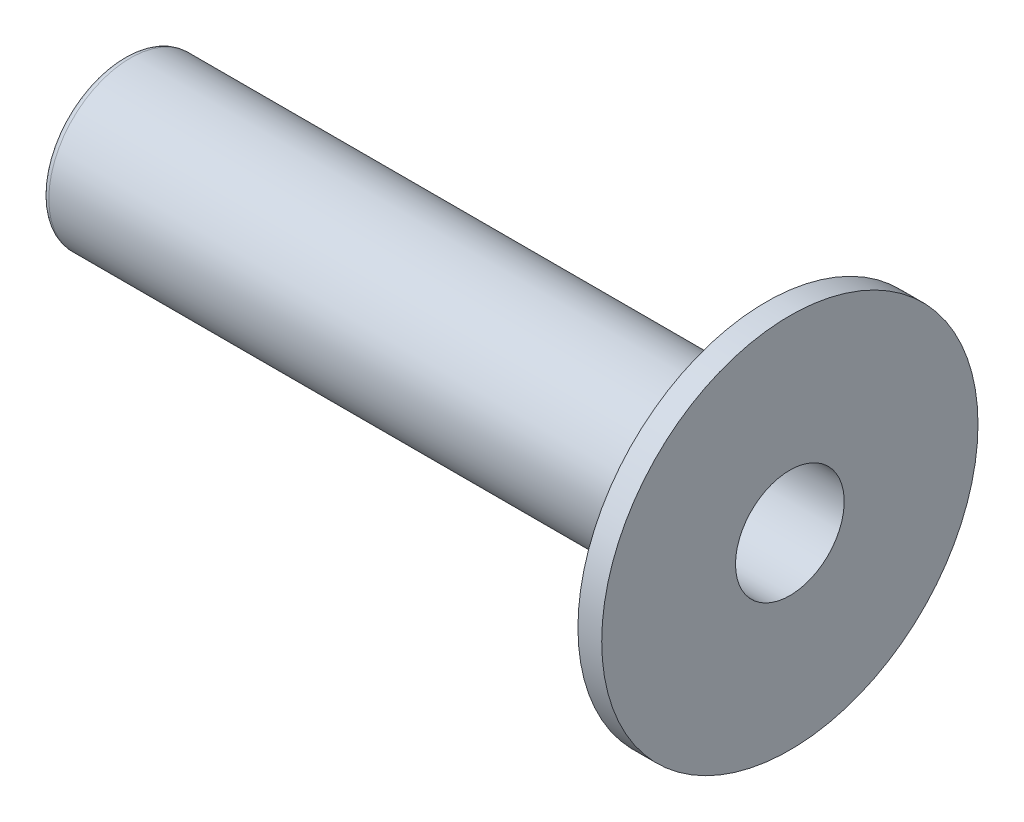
ISO-10303-21;
HEADER;
FILE_DESCRIPTION(('STEP AP214'),'2;1');
FILE_NAME('part.step','',(''),(''),'','','');
FILE_SCHEMA(('AUTOMOTIVE_DESIGN { 1 0 10303 214 1 1 1 1 }'));
ENDSEC;
DATA;
#1=APPLICATION_CONTEXT('core data for automotive mechanical design processes');
#2=APPLICATION_PROTOCOL_DEFINITION('international standard','automotive_design',2000,#1);
#3=PRODUCT_CONTEXT('',#1,'mechanical');
#4=PRODUCT('Part','Part','',(#3));
#5=PRODUCT_RELATED_PRODUCT_CATEGORY('part','',(#4));
#6=PRODUCT_DEFINITION_FORMATION('','',#4);
#7=PRODUCT_DEFINITION_CONTEXT('part definition',#1,'design');
#8=PRODUCT_DEFINITION('design','',#6,#7);
#9=PRODUCT_DEFINITION_SHAPE('','',#8);
#10=(LENGTH_UNIT() NAMED_UNIT(*) SI_UNIT(.MILLI.,.METRE.));
#11=(NAMED_UNIT(*) PLANE_ANGLE_UNIT() SI_UNIT($,.RADIAN.));
#12=(NAMED_UNIT(*) SI_UNIT($,.STERADIAN.) SOLID_ANGLE_UNIT());
#13=UNCERTAINTY_MEASURE_WITH_UNIT(LENGTH_MEASURE(1.E-05),#10,'distance_accuracy_value','');
#14=(GEOMETRIC_REPRESENTATION_CONTEXT(3) GLOBAL_UNCERTAINTY_ASSIGNED_CONTEXT((#13)) GLOBAL_UNIT_ASSIGNED_CONTEXT((#10,
#11,#12)) REPRESENTATION_CONTEXT('',''));
#15=CARTESIAN_POINT('',(0.,0.,0.));
#16=DIRECTION('',(0.,0.,1.));
#17=DIRECTION('',(1.,0.,0.));
#18=AXIS2_PLACEMENT_3D('',#15,#16,#17);
#19=CARTESIAN_POINT('',(0.,1.35255,0.));
#20=DIRECTION('',(1.,0.,0.));
#21=DIRECTION('',(0.,0.,-1.));
#22=AXIS2_PLACEMENT_3D('',#19,#20,#21);
#23=PLANE('',#22);
#24=CARTESIAN_POINT('',(0.,0.,0.));
#25=DIRECTION('',(-1.,0.,0.));
#26=DIRECTION('',(0.,0.,1.));
#27=AXIS2_PLACEMENT_3D('',#24,#25,#26);
#28=CIRCLE('',#27,2.794);
#29=CARTESIAN_POINT('',(0.,0.,2.794));
#30=VERTEX_POINT('',#29);
#31=EDGE_CURVE('E56',#30,#30,#28,.T.);
#32=ORIENTED_EDGE('',*,*,#31,.T.);
#33=EDGE_LOOP('',(#32));
#34=FACE_BOUND('',#33,.T.);
#35=CARTESIAN_POINT('',(0.,0.,0.));
#36=DIRECTION('',(1.,0.,0.));
#37=DIRECTION('',(0.,0.,-1.));
#38=AXIS2_PLACEMENT_3D('',#35,#36,#37);
#39=CIRCLE('',#38,1.905);
#40=CARTESIAN_POINT('',(0.,0.,-1.905));
#41=VERTEX_POINT('',#40);
#42=EDGE_CURVE('E10',#41,#41,#39,.F.);
#43=ORIENTED_EDGE('',*,*,#42,.F.);
#44=EDGE_LOOP('',(#43));
#45=FACE_BOUND('',#44,.T.);
#46=ADVANCED_FACE('F30',(#34,#45),#23,.F.);
#47=CARTESIAN_POINT('',(0.,0.,0.));
#48=DIRECTION('',(-1.,0.,0.));
#49=DIRECTION('',(0.,0.,1.));
#50=AXIS2_PLACEMENT_3D('',#47,#48,#49);
#51=CYLINDRICAL_SURFACE('',#50,7.0358);
#52=CARTESIAN_POINT('',(24.0284,0.,0.));
#53=DIRECTION('',(-1.,0.,0.));
#54=DIRECTION('',(0.,0.,1.));
#55=AXIS2_PLACEMENT_3D('',#52,#53,#54);
#56=CIRCLE('',#55,7.0358);
#57=CARTESIAN_POINT('',(24.0284,0.,7.0358));
#58=VERTEX_POINT('',#57);
#59=EDGE_CURVE('E38',#58,#58,#56,.T.);
#60=ORIENTED_EDGE('',*,*,#59,.F.);
#61=EDGE_LOOP('',(#60));
#62=FACE_BOUND('',#61,.T.);
#63=CARTESIAN_POINT('',(24.9174,0.,0.));
#64=DIRECTION('',(-1.,0.,0.));
#65=DIRECTION('',(0.,0.,1.));
#66=AXIS2_PLACEMENT_3D('',#63,#64,#65);
#67=CIRCLE('',#66,7.0358);
#68=CARTESIAN_POINT('',(24.9174,0.,7.0358));
#69=VERTEX_POINT('',#68);
#70=EDGE_CURVE('E71',#69,#69,#67,.T.);
#71=ORIENTED_EDGE('',*,*,#70,.T.);
#72=EDGE_LOOP('',(#71));
#73=FACE_BOUND('',#72,.T.);
#74=ADVANCED_FACE('F32',(#62,#73),#51,.T.);
#75=CARTESIAN_POINT('',(24.0284,3.302,0.));
#76=DIRECTION('',(1.,0.,0.));
#77=DIRECTION('',(0.,0.,-1.));
#78=AXIS2_PLACEMENT_3D('',#75,#76,#77);
#79=PLANE('',#78);
#80=CARTESIAN_POINT('',(24.0284,0.,0.));
#81=DIRECTION('',(-1.,0.,0.));
#82=DIRECTION('',(0.,0.,1.));
#83=AXIS2_PLACEMENT_3D('',#80,#81,#82);
#84=CIRCLE('',#83,3.302);
#85=CARTESIAN_POINT('',(24.0284,0.,3.302));
#86=VERTEX_POINT('',#85);
#87=EDGE_CURVE('E44',#86,#86,#84,.T.);
#88=ORIENTED_EDGE('',*,*,#87,.F.);
#89=EDGE_LOOP('',(#88));
#90=FACE_BOUND('',#89,.T.);
#91=ORIENTED_EDGE('',*,*,#59,.T.);
#92=EDGE_LOOP('',(#91));
#93=FACE_BOUND('',#92,.T.);
#94=ADVANCED_FACE('F115',(#90,#93),#79,.F.);
#95=CARTESIAN_POINT('',(23.7744,0.,0.));
#96=DIRECTION('',(-1.,0.,0.));
#97=DIRECTION('',(0.,0.,1.));
#98=AXIS2_PLACEMENT_3D('',#95,#96,#97);
#99=TOROIDAL_SURFACE('',#98,3.302,0.253999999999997);
#100=CARTESIAN_POINT('',(23.7744,0.,0.));
#101=DIRECTION('',(-1.,0.,0.));
#102=DIRECTION('',(0.,0.,1.));
#103=AXIS2_PLACEMENT_3D('',#100,#101,#102);
#104=CIRCLE('',#103,3.048);
#105=CARTESIAN_POINT('',(23.7744,0.,3.048));
#106=VERTEX_POINT('',#105);
#107=EDGE_CURVE('E48',#106,#106,#104,.T.);
#108=ORIENTED_EDGE('',*,*,#107,.F.);
#109=EDGE_LOOP('',(#108));
#110=FACE_BOUND('',#109,.T.);
#111=ORIENTED_EDGE('',*,*,#87,.T.);
#112=EDGE_LOOP('',(#111));
#113=FACE_BOUND('',#112,.T.);
#114=ADVANCED_FACE('F124',(#110,#113),#99,.F.);
#115=CARTESIAN_POINT('',(0.,0.,0.));
#116=DIRECTION('',(-1.,0.,0.));
#117=DIRECTION('',(0.,0.,1.));
#118=AXIS2_PLACEMENT_3D('',#115,#116,#117);
#119=CYLINDRICAL_SURFACE('',#118,3.048);
#120=CARTESIAN_POINT('',(0.254,0.,0.));
#121=DIRECTION('',(-1.,0.,0.));
#122=DIRECTION('',(0.,0.,1.));
#123=AXIS2_PLACEMENT_3D('',#120,#121,#122);
#124=CIRCLE('',#123,3.048);
#125=CARTESIAN_POINT('',(0.254,0.,3.048));
#126=VERTEX_POINT('',#125);
#127=EDGE_CURVE('E53',#126,#126,#124,.T.);
#128=ORIENTED_EDGE('',*,*,#127,.F.);
#129=EDGE_LOOP('',(#128));
#130=FACE_BOUND('',#129,.T.);
#131=ORIENTED_EDGE('',*,*,#107,.T.);
#132=EDGE_LOOP('',(#131));
#133=FACE_BOUND('',#132,.T.);
#134=ADVANCED_FACE('F107',(#130,#133),#119,.T.);
#135=CARTESIAN_POINT('',(0.254,0.,0.));
#136=DIRECTION('',(-1.,0.,0.));
#137=DIRECTION('',(0.,0.,1.));
#138=AXIS2_PLACEMENT_3D('',#135,#136,#137);
#139=TOROIDAL_SURFACE('',#138,2.794,0.254);
#140=ORIENTED_EDGE('',*,*,#31,.F.);
#141=EDGE_LOOP('',(#140));
#142=FACE_BOUND('',#141,.T.);
#143=ORIENTED_EDGE('',*,*,#127,.T.);
#144=EDGE_LOOP('',(#143));
#145=FACE_BOUND('',#144,.T.);
#146=ADVANCED_FACE('F102',(#142,#145),#139,.T.);
#147=ORIENTED_EDGE('',*,*,#42,.T.);
#148=EDGE_LOOP('',(#147));
#149=FACE_BOUND('',#148,.T.);
#150=CARTESIAN_POINT('',(0.,0.,0.));
#151=DIRECTION('',(-1.,0.,0.));
#152=DIRECTION('',(0.,0.,1.));
#153=AXIS2_PLACEMENT_3D('',#150,#151,#152);
#154=CIRCLE('',#153,1.35255);
#155=CARTESIAN_POINT('',(0.,0.,1.35255));
#156=VERTEX_POINT('',#155);
#157=EDGE_CURVE('E59',#156,#156,#154,.T.);
#158=ORIENTED_EDGE('',*,*,#157,.F.);
#159=EDGE_LOOP('',(#158));
#160=FACE_BOUND('',#159,.T.);
#161=ADVANCED_FACE('F97',(#149,#160),#23,.F.);
#162=CARTESIAN_POINT('',(0.,0.,0.));
#163=DIRECTION('',(-1.,0.,0.));
#164=DIRECTION('',(0.,0.,1.));
#165=AXIS2_PLACEMENT_3D('',#162,#163,#164);
#166=CYLINDRICAL_SURFACE('',#165,1.35255);
#167=CARTESIAN_POINT('',(4.7244,0.,0.));
#168=DIRECTION('',(-1.,0.,0.));
#169=DIRECTION('',(0.,0.,1.));
#170=AXIS2_PLACEMENT_3D('',#167,#168,#169);
#171=CIRCLE('',#170,1.35255);
#172=CARTESIAN_POINT('',(4.7244,0.,1.35255));
#173=VERTEX_POINT('',#172);
#174=EDGE_CURVE('E62',#173,#173,#171,.T.);
#175=ORIENTED_EDGE('',*,*,#174,.F.);
#176=EDGE_LOOP('',(#175));
#177=FACE_BOUND('',#176,.T.);
#178=ORIENTED_EDGE('',*,*,#157,.T.);
#179=EDGE_LOOP('',(#178));
#180=FACE_BOUND('',#179,.T.);
#181=ADVANCED_FACE('F91',(#177,#180),#166,.F.);
#182=CARTESIAN_POINT('',(4.7244,1.35255,0.));
#183=DIRECTION('',(-1.,0.,0.));
#184=DIRECTION('',(0.,0.,1.));
#185=AXIS2_PLACEMENT_3D('',#182,#183,#184);
#186=PLANE('',#185);
#187=CARTESIAN_POINT('',(4.7244,0.,0.));
#188=DIRECTION('',(-1.,0.,0.));
#189=DIRECTION('',(0.,0.,1.));
#190=AXIS2_PLACEMENT_3D('',#187,#188,#189);
#191=CIRCLE('',#190,2.032);
#192=CARTESIAN_POINT('',(4.7244,0.,2.032));
#193=VERTEX_POINT('',#192);
#194=EDGE_CURVE('E65',#193,#193,#191,.T.);
#195=ORIENTED_EDGE('',*,*,#194,.F.);
#196=EDGE_LOOP('',(#195));
#197=FACE_BOUND('',#196,.T.);
#198=ORIENTED_EDGE('',*,*,#174,.T.);
#199=EDGE_LOOP('',(#198));
#200=FACE_BOUND('',#199,.T.);
#201=ADVANCED_FACE('F85',(#197,#200),#186,.F.);
#202=CARTESIAN_POINT('',(0.,0.,0.));
#203=DIRECTION('',(-1.,0.,0.));
#204=DIRECTION('',(0.,0.,1.));
#205=AXIS2_PLACEMENT_3D('',#202,#203,#204);
#206=CYLINDRICAL_SURFACE('',#205,2.032);
#207=CARTESIAN_POINT('',(24.9174,0.,0.));
#208=DIRECTION('',(-1.,0.,0.));
#209=DIRECTION('',(0.,0.,1.));
#210=AXIS2_PLACEMENT_3D('',#207,#208,#209);
#211=CIRCLE('',#210,2.032);
#212=CARTESIAN_POINT('',(24.9174,0.,2.032));
#213=VERTEX_POINT('',#212);
#214=EDGE_CURVE('E68',#213,#213,#211,.T.);
#215=ORIENTED_EDGE('',*,*,#214,.F.);
#216=EDGE_LOOP('',(#215));
#217=FACE_BOUND('',#216,.T.);
#218=ORIENTED_EDGE('',*,*,#194,.T.);
#219=EDGE_LOOP('',(#218));
#220=FACE_BOUND('',#219,.T.);
#221=ADVANCED_FACE('F79',(#217,#220),#206,.F.);
#222=CARTESIAN_POINT('',(24.9174,7.0358,0.));
#223=DIRECTION('',(-1.,0.,0.));
#224=DIRECTION('',(0.,0.,1.));
#225=AXIS2_PLACEMENT_3D('',#222,#223,#224);
#226=PLANE('',#225);
#227=ORIENTED_EDGE('',*,*,#70,.F.);
#228=EDGE_LOOP('',(#227));
#229=FACE_BOUND('',#228,.T.);
#230=ORIENTED_EDGE('',*,*,#214,.T.);
#231=EDGE_LOOP('',(#230));
#232=FACE_BOUND('',#231,.T.);
#233=ADVANCED_FACE('F76',(#229,#232),#226,.F.);
#234=CLOSED_SHELL('',(#46,#74,#94,#114,#134,#146,#161,#181,#201,#221,#233));
#235=MANIFOLD_SOLID_BREP('B2',#234);
#236=ADVANCED_BREP_SHAPE_REPRESENTATION('',(#18,#235),#14);
#237=SHAPE_DEFINITION_REPRESENTATION(#9,#236);
ENDSEC;
END-ISO-10303-21;
